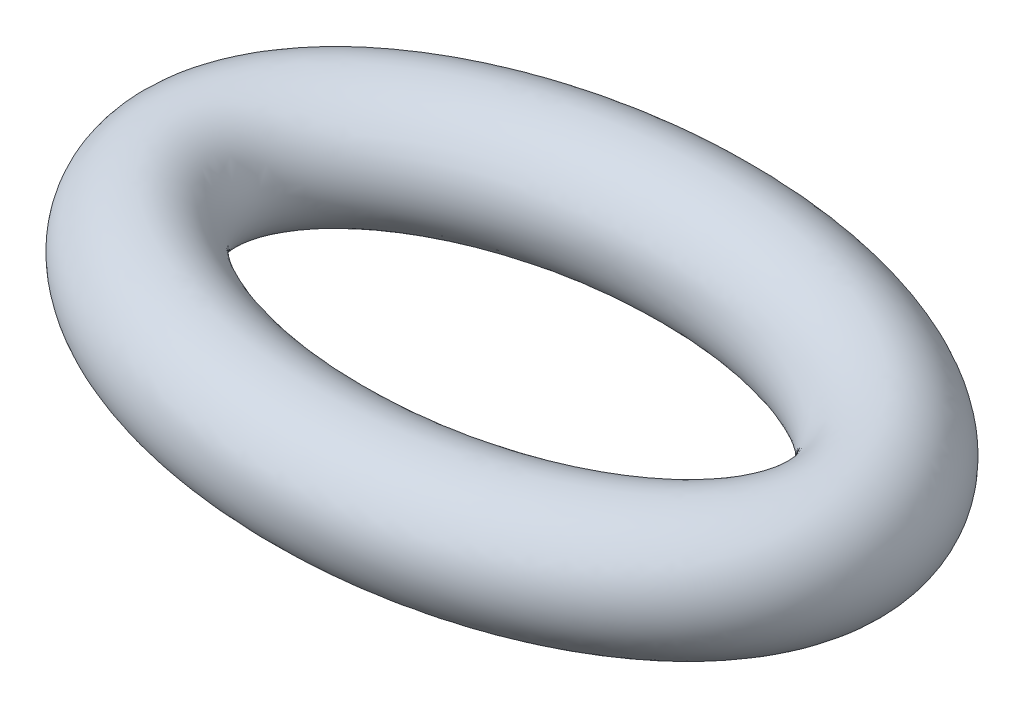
from build123d import *

# Parameters (mm, degrees)
SKETCH2_R = 3.175


with BuildPart() as part:
    # Sweep1: sweep along a path in Sketch1
    with BuildLine(Plane(origin=(0, 0, 0), x_dir=(1, 0, 0), z_dir=(0, 1, 0))) as sweep1_path:
        EllipticalCenterArc((0, 0), 15.875, 9.525, start_angle=0, arc_size=360)
    # Sketch2 → Sweep1 (sweep)
    with BuildSketch(Plane.XY):
        with Locations((15.875, 0)):
            Circle(SKETCH2_R)
    sweep(path=sweep1_path.line)


solid = part.part
